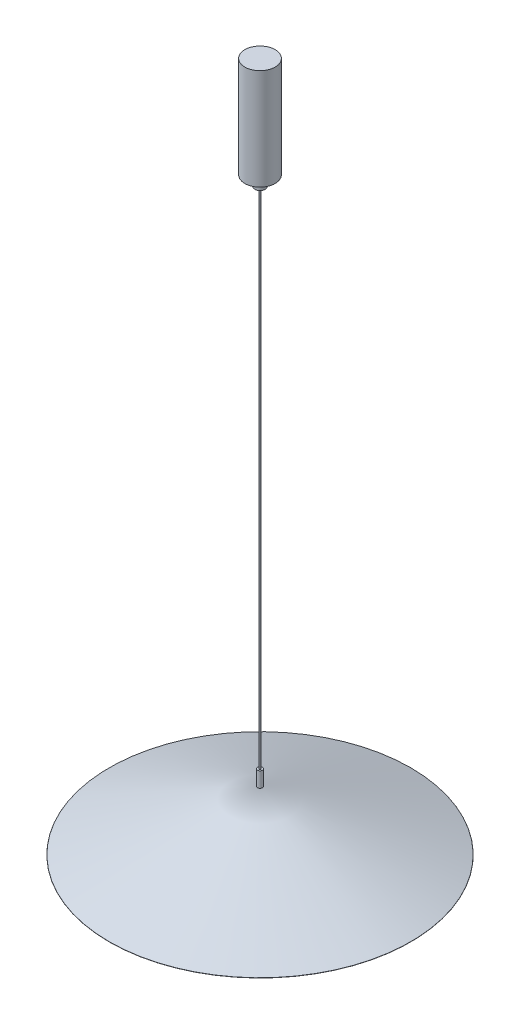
ISO-10303-21;
HEADER;
FILE_DESCRIPTION(('STEP AP214'),'2;1');
FILE_NAME('part.step','',(''),(''),'','','');
FILE_SCHEMA(('AUTOMOTIVE_DESIGN { 1 0 10303 214 1 1 1 1 }'));
ENDSEC;
DATA;
#1=APPLICATION_CONTEXT('core data for automotive mechanical design processes');
#2=APPLICATION_PROTOCOL_DEFINITION('international standard','automotive_design',2000,#1);
#3=PRODUCT_CONTEXT('',#1,'mechanical');
#4=PRODUCT('Part','Part','',(#3));
#5=PRODUCT_RELATED_PRODUCT_CATEGORY('part','',(#4));
#6=PRODUCT_DEFINITION_FORMATION('','',#4);
#7=PRODUCT_DEFINITION_CONTEXT('part definition',#1,'design');
#8=PRODUCT_DEFINITION('design','',#6,#7);
#9=PRODUCT_DEFINITION_SHAPE('','',#8);
#10=(LENGTH_UNIT() NAMED_UNIT(*) SI_UNIT(.MILLI.,.METRE.));
#11=(NAMED_UNIT(*) PLANE_ANGLE_UNIT() SI_UNIT($,.RADIAN.));
#12=(NAMED_UNIT(*) SI_UNIT($,.STERADIAN.) SOLID_ANGLE_UNIT());
#13=UNCERTAINTY_MEASURE_WITH_UNIT(LENGTH_MEASURE(1.E-05),#10,'distance_accuracy_value','');
#14=(GEOMETRIC_REPRESENTATION_CONTEXT(3) GLOBAL_UNCERTAINTY_ASSIGNED_CONTEXT((#13)) GLOBAL_UNIT_ASSIGNED_CONTEXT((#10,
#11,#12)) REPRESENTATION_CONTEXT('',''));
#15=CARTESIAN_POINT('',(0.,0.,0.));
#16=DIRECTION('',(0.,0.,1.));
#17=DIRECTION('',(1.,0.,0.));
#18=AXIS2_PLACEMENT_3D('',#15,#16,#17);
#19=CARTESIAN_POINT('',(0.,65.,0.));
#20=DIRECTION('',(0.,-1.,0.));
#21=DIRECTION('',(1.,0.,0.));
#22=AXIS2_PLACEMENT_3D('',#19,#20,#21);
#23=CYLINDRICAL_SURFACE('',#22,20.);
#24=CARTESIAN_POINT('',(0.,65.,0.));
#25=DIRECTION('',(0.,-1.,0.));
#26=DIRECTION('',(1.,0.,0.));
#27=AXIS2_PLACEMENT_3D('',#24,#25,#26);
#28=CIRCLE('',#27,20.);
#29=CARTESIAN_POINT('',(20.,65.,0.));
#30=VERTEX_POINT('',#29);
#31=EDGE_CURVE('E12',#30,#30,#28,.T.);
#32=ORIENTED_EDGE('',*,*,#31,.T.);
#33=EDGE_LOOP('',(#32));
#34=FACE_BOUND('',#33,.T.);
#35=CARTESIAN_POINT('',(0.,-95.,0.));
#36=DIRECTION('',(0.,-1.,0.));
#37=DIRECTION('',(1.,0.,0.));
#38=AXIS2_PLACEMENT_3D('',#35,#36,#37);
#39=CIRCLE('',#38,20.);
#40=CARTESIAN_POINT('',(20.,-95.,0.));
#41=VERTEX_POINT('',#40);
#42=EDGE_CURVE('E60',#41,#41,#39,.T.);
#43=ORIENTED_EDGE('',*,*,#42,.F.);
#44=EDGE_LOOP('',(#43));
#45=FACE_BOUND('',#44,.T.);
#46=ADVANCED_FACE('F57',(#34,#45),#23,.T.);
#47=CARTESIAN_POINT('',(0.,65.,0.));
#48=DIRECTION('',(0.,-1.,0.));
#49=DIRECTION('',(1.,0.,0.));
#50=AXIS2_PLACEMENT_3D('',#47,#48,#49);
#51=PLANE('',#50);
#52=ORIENTED_EDGE('',*,*,#31,.F.);
#53=EDGE_LOOP('',(#52));
#54=FACE_BOUND('',#53,.T.);
#55=ADVANCED_FACE('F74',(#54),#51,.F.);
#56=CARTESIAN_POINT('',(0.,-95.,0.));
#57=DIRECTION('',(0.,-1.,0.));
#58=DIRECTION('',(1.,0.,0.));
#59=AXIS2_PLACEMENT_3D('',#56,#57,#58);
#60=PLANE('',#59);
#61=ORIENTED_EDGE('',*,*,#42,.T.);
#62=EDGE_LOOP('',(#61));
#63=FACE_BOUND('',#62,.T.);
#64=ADVANCED_FACE('F71',(#63),#60,.T.);
#65=CLOSED_SHELL('',(#46,#55,#64));
#66=MANIFOLD_SOLID_BREP('B2',#65);
#67=CARTESIAN_POINT('',(0.,1368.,0.));
#68=DIRECTION('',(0.,-1.,0.));
#69=DIRECTION('',(0.,0.,-1.));
#70=AXIS2_PLACEMENT_3D('',#67,#68,#69);
#71=CYLINDRICAL_SURFACE('',#70,30.);
#72=CARTESIAN_POINT('',(0.,1368.,0.));
#73=DIRECTION('',(0.,1.,0.));
#74=DIRECTION('',(0.,0.,1.));
#75=AXIS2_PLACEMENT_3D('',#72,#73,#74);
#76=CIRCLE('',#75,30.);
#77=CARTESIAN_POINT('',(0.,1368.,30.));
#78=VERTEX_POINT('',#77);
#79=EDGE_CURVE('E56',#78,#78,#76,.T.);
#80=ORIENTED_EDGE('',*,*,#79,.F.);
#81=EDGE_LOOP('',(#80));
#82=FACE_BOUND('',#81,.T.);
#83=CARTESIAN_POINT('',(0.,1168.,0.));
#84=DIRECTION('',(0.,1.,0.));
#85=DIRECTION('',(0.,0.,1.));
#86=AXIS2_PLACEMENT_3D('',#83,#84,#85);
#87=CIRCLE('',#86,30.);
#88=CARTESIAN_POINT('',(0.,1168.,30.));
#89=VERTEX_POINT('',#88);
#90=EDGE_CURVE('E113',#89,#89,#87,.T.);
#91=ORIENTED_EDGE('',*,*,#90,.T.);
#92=EDGE_LOOP('',(#91));
#93=FACE_BOUND('',#92,.T.);
#94=ADVANCED_FACE('F110',(#82,#93),#71,.T.);
#95=CARTESIAN_POINT('',(0.,1368.,0.));
#96=DIRECTION('',(0.,1.,0.));
#97=DIRECTION('',(0.,0.,1.));
#98=AXIS2_PLACEMENT_3D('',#95,#96,#97);
#99=PLANE('',#98);
#100=ORIENTED_EDGE('',*,*,#79,.T.);
#101=EDGE_LOOP('',(#100));
#102=FACE_BOUND('',#101,.T.);
#103=ADVANCED_FACE('F127',(#102),#99,.T.);
#104=CARTESIAN_POINT('',(0.,1168.,0.));
#105=DIRECTION('',(0.,1.,0.));
#106=DIRECTION('',(0.,0.,1.));
#107=AXIS2_PLACEMENT_3D('',#104,#105,#106);
#108=PLANE('',#107);
#109=ORIENTED_EDGE('',*,*,#90,.F.);
#110=EDGE_LOOP('',(#109));
#111=FACE_BOUND('',#110,.T.);
#112=ADVANCED_FACE('F125',(#111),#108,.F.);
#113=CLOSED_SHELL('',(#94,#103,#112));
#114=MANIFOLD_SOLID_BREP('B7',#113);
#115=CARTESIAN_POINT('',(0.,1168.,0.));
#116=DIRECTION('',(0.,-1.,0.));
#117=DIRECTION('',(0.,0.,-1.));
#118=AXIS2_PLACEMENT_3D('',#115,#116,#117);
#119=CYLINDRICAL_SURFACE('',#118,10.);
#120=CARTESIAN_POINT('',(0.,1168.,0.));
#121=DIRECTION('',(0.,1.,0.));
#122=DIRECTION('',(0.,0.,1.));
#123=AXIS2_PLACEMENT_3D('',#120,#121,#122);
#124=CIRCLE('',#123,10.);
#125=CARTESIAN_POINT('',(0.,1168.,10.));
#126=VERTEX_POINT('',#125);
#127=EDGE_CURVE('E109',#126,#126,#124,.T.);
#128=ORIENTED_EDGE('',*,*,#127,.F.);
#129=EDGE_LOOP('',(#128));
#130=FACE_BOUND('',#129,.T.);
#131=CARTESIAN_POINT('',(0.,1148.,0.));
#132=DIRECTION('',(0.,1.,0.));
#133=DIRECTION('',(0.,0.,1.));
#134=AXIS2_PLACEMENT_3D('',#131,#132,#133);
#135=CIRCLE('',#134,10.);
#136=CARTESIAN_POINT('',(0.,1148.,10.));
#137=VERTEX_POINT('',#136);
#138=EDGE_CURVE('E166',#137,#137,#135,.T.);
#139=ORIENTED_EDGE('',*,*,#138,.T.);
#140=EDGE_LOOP('',(#139));
#141=FACE_BOUND('',#140,.T.);
#142=ADVANCED_FACE('F163',(#130,#141),#119,.T.);
#143=CARTESIAN_POINT('',(0.,1168.,0.));
#144=DIRECTION('',(0.,1.,0.));
#145=DIRECTION('',(0.,0.,1.));
#146=AXIS2_PLACEMENT_3D('',#143,#144,#145);
#147=PLANE('',#146);
#148=ORIENTED_EDGE('',*,*,#127,.T.);
#149=EDGE_LOOP('',(#148));
#150=FACE_BOUND('',#149,.T.);
#151=ADVANCED_FACE('F180',(#150),#147,.T.);
#152=CARTESIAN_POINT('',(0.,1148.,0.));
#153=DIRECTION('',(0.,1.,0.));
#154=DIRECTION('',(0.,0.,1.));
#155=AXIS2_PLACEMENT_3D('',#152,#153,#154);
#156=PLANE('',#155);
#157=ORIENTED_EDGE('',*,*,#138,.F.);
#158=EDGE_LOOP('',(#157));
#159=FACE_BOUND('',#158,.T.);
#160=ADVANCED_FACE('F178',(#159),#156,.F.);
#161=CLOSED_SHELL('',(#142,#151,#160));
#162=MANIFOLD_SOLID_BREP('B51',#161);
#163=CARTESIAN_POINT('',(0.,1148.,0.));
#164=DIRECTION('',(0.,-1.,0.));
#165=DIRECTION('',(0.,0.,-1.));
#166=AXIS2_PLACEMENT_3D('',#163,#164,#165);
#167=CYLINDRICAL_SURFACE('',#166,1.5);
#168=CARTESIAN_POINT('',(0.,1148.,0.));
#169=DIRECTION('',(0.,1.,0.));
#170=DIRECTION('',(0.,0.,1.));
#171=AXIS2_PLACEMENT_3D('',#168,#169,#170);
#172=CIRCLE('',#171,1.5);
#173=CARTESIAN_POINT('',(0.,1148.,1.5));
#174=VERTEX_POINT('',#173);
#175=EDGE_CURVE('E162',#174,#174,#172,.T.);
#176=ORIENTED_EDGE('',*,*,#175,.F.);
#177=EDGE_LOOP('',(#176));
#178=FACE_BOUND('',#177,.T.);
#179=CARTESIAN_POINT('',(0.,148.,0.));
#180=DIRECTION('',(0.,1.,0.));
#181=DIRECTION('',(0.,0.,1.));
#182=AXIS2_PLACEMENT_3D('',#179,#180,#181);
#183=CIRCLE('',#182,1.5);
#184=CARTESIAN_POINT('',(0.,148.,1.5));
#185=VERTEX_POINT('',#184);
#186=EDGE_CURVE('E221',#185,#185,#183,.T.);
#187=ORIENTED_EDGE('',*,*,#186,.T.);
#188=EDGE_LOOP('',(#187));
#189=FACE_BOUND('',#188,.T.);
#190=ADVANCED_FACE('F218',(#178,#189),#167,.T.);
#191=CARTESIAN_POINT('',(0.,1148.,0.));
#192=DIRECTION('',(0.,1.,0.));
#193=DIRECTION('',(0.,0.,1.));
#194=AXIS2_PLACEMENT_3D('',#191,#192,#193);
#195=PLANE('',#194);
#196=ORIENTED_EDGE('',*,*,#175,.T.);
#197=EDGE_LOOP('',(#196));
#198=FACE_BOUND('',#197,.T.);
#199=ADVANCED_FACE('F235',(#198),#195,.T.);
#200=CARTESIAN_POINT('',(0.,148.,0.));
#201=DIRECTION('',(0.,1.,0.));
#202=DIRECTION('',(0.,0.,1.));
#203=AXIS2_PLACEMENT_3D('',#200,#201,#202);
#204=PLANE('',#203);
#205=ORIENTED_EDGE('',*,*,#186,.F.);
#206=EDGE_LOOP('',(#205));
#207=FACE_BOUND('',#206,.T.);
#208=ADVANCED_FACE('F233',(#207),#204,.F.);
#209=CLOSED_SHELL('',(#190,#199,#208));
#210=MANIFOLD_SOLID_BREP('B104',#209);
#211=CARTESIAN_POINT('',(0.,118.,0.));
#212=DIRECTION('',(0.,1.,0.));
#213=DIRECTION('',(0.,0.,1.));
#214=AXIS2_PLACEMENT_3D('',#211,#212,#213);
#215=PLANE('',#214);
#216=CARTESIAN_POINT('',(0.,118.,0.));
#217=DIRECTION('',(0.,1.,0.));
#218=DIRECTION('',(0.,0.,1.));
#219=AXIS2_PLACEMENT_3D('',#216,#217,#218);
#220=CIRCLE('',#219,5.);
#221=CARTESIAN_POINT('',(0.,118.,5.));
#222=VERTEX_POINT('',#221);
#223=EDGE_CURVE('E279',#222,#222,#220,.T.);
#224=ORIENTED_EDGE('',*,*,#223,.F.);
#225=EDGE_LOOP('',(#224));
#226=FACE_BOUND('',#225,.T.);
#227=ADVANCED_FACE('F271',(#226),#215,.F.);
#228=CARTESIAN_POINT('',(0.,148.,0.));
#229=DIRECTION('',(0.,1.,0.));
#230=DIRECTION('',(0.,0.,1.));
#231=AXIS2_PLACEMENT_3D('',#228,#229,#230);
#232=PLANE('',#231);
#233=CARTESIAN_POINT('',(0.,148.,0.));
#234=DIRECTION('',(0.,1.,0.));
#235=DIRECTION('',(0.,0.,1.));
#236=AXIS2_PLACEMENT_3D('',#233,#234,#235);
#237=CIRCLE('',#236,5.);
#238=CARTESIAN_POINT('',(0.,148.,5.));
#239=VERTEX_POINT('',#238);
#240=EDGE_CURVE('E216',#239,#239,#237,.T.);
#241=ORIENTED_EDGE('',*,*,#240,.T.);
#242=EDGE_LOOP('',(#241));
#243=FACE_BOUND('',#242,.T.);
#244=ADVANCED_FACE('F286',(#243),#232,.T.);
#245=CARTESIAN_POINT('',(0.,118.,0.));
#246=DIRECTION('',(0.,1.,0.));
#247=DIRECTION('',(0.,0.,1.));
#248=AXIS2_PLACEMENT_3D('',#245,#246,#247);
#249=CYLINDRICAL_SURFACE('',#248,5.);
#250=ORIENTED_EDGE('',*,*,#240,.F.);
#251=EDGE_LOOP('',(#250));
#252=FACE_BOUND('',#251,.T.);
#253=ORIENTED_EDGE('',*,*,#223,.T.);
#254=EDGE_LOOP('',(#253));
#255=FACE_BOUND('',#254,.T.);
#256=ADVANCED_FACE('F288',(#252,#255),#249,.T.);
#257=CLOSED_SHELL('',(#227,#244,#256));
#258=MANIFOLD_SOLID_BREP('B157',#257);
#259=CARTESIAN_POINT('',(0.,-70.,0.));
#260=DIRECTION('',(0.,1.,0.));
#261=DIRECTION('',(0.,0.,1.));
#262=AXIS2_PLACEMENT_3D('',#259,#260,#261);
#263=PLANE('',#262);
#264=CARTESIAN_POINT('',(0.,-70.,0.));
#265=DIRECTION('',(0.,1.,0.));
#266=DIRECTION('',(0.,0.,1.));
#267=AXIS2_PLACEMENT_3D('',#264,#265,#266);
#268=CIRCLE('',#267,149.);
#269=CARTESIAN_POINT('',(0.,-70.,149.));
#270=VERTEX_POINT('',#269);
#271=EDGE_CURVE('E343',#270,#270,#268,.T.);
#272=ORIENTED_EDGE('',*,*,#271,.T.);
#273=EDGE_LOOP('',(#272));
#274=FACE_BOUND('',#273,.T.);
#275=CARTESIAN_POINT('',(0.,-70.,0.));
#276=DIRECTION('',(0.,1.,0.));
#277=DIRECTION('',(0.,0.,1.));
#278=AXIS2_PLACEMENT_3D('',#275,#276,#277);
#279=CIRCLE('',#278,121.450195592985);
#280=CARTESIAN_POINT('',(0.,-70.,121.450195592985));
#281=VERTEX_POINT('',#280);
#282=EDGE_CURVE('E357',#281,#281,#279,.F.);
#283=ORIENTED_EDGE('',*,*,#282,.T.);
#284=EDGE_LOOP('',(#283));
#285=FACE_BOUND('',#284,.T.);
#286=ADVANCED_FACE('F328',(#274,#285),#263,.T.);
#287=CARTESIAN_POINT('',(0.,-109.238433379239,0.));
#288=DIRECTION('',(0.,1.,0.));
#289=DIRECTION('',(0.,0.,1.));
#290=AXIS2_PLACEMENT_3D('',#287,#288,#289);
#291=CONICAL_SURFACE('',#290,2.28469986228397,1.31115685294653);
#292=CARTESIAN_POINT('',(0.,-108.903259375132,0.));
#293=DIRECTION('',(0.,-1.,0.));
#294=DIRECTION('',(0.,0.,-1.));
#295=AXIS2_PLACEMENT_3D('',#292,#293,#294);
#296=CIRCLE('',#295,3.54648134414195);
#297=CARTESIAN_POINT('',(0.,-108.903259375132,3.54648134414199));
#298=VERTEX_POINT('',#297);
#299=EDGE_CURVE('E270',#298,#298,#296,.F.);
#300=CARTESIAN_POINT('',(0.,-70.2098831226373,0.));
#301=DIRECTION('',(0.,-1.,0.));
#302=DIRECTION('',(0.,0.,-1.));
#303=AXIS2_PLACEMENT_3D('',#300,#301,#302);
#304=CIRCLE('',#303,149.209883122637);
#305=CARTESIAN_POINT('',(0.,-70.2098831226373,149.209883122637));
#306=VERTEX_POINT('',#305);
#307=EDGE_CURVE('E348',#306,#306,#304,.T.);
#308=CARTESIAN_POINT('',(0.,-108.903259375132,3.54648134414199));
#309=CARTESIAN_POINT('',(0.,-108.500203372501,5.06380844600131));
#310=CARTESIAN_POINT('',(0.,-108.097147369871,6.58113554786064));
#311=CARTESIAN_POINT('',(0.,-107.291035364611,9.61578975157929));
#312=CARTESIAN_POINT('',(0.,-106.887979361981,11.1331168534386));
#313=CARTESIAN_POINT('',(0.,-106.081867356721,14.1677710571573));
#314=CARTESIAN_POINT('',(0.,-105.67881135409,15.6850981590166));
#315=CARTESIAN_POINT('',(0.,-104.87269934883,18.7197523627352));
#316=CARTESIAN_POINT('',(0.,-104.4696433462,20.2370794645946));
#317=CARTESIAN_POINT('',(0.,-103.66353134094,23.2717336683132));
#318=CARTESIAN_POINT('',(0.,-103.260475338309,24.7890607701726));
#319=CARTESIAN_POINT('',(0.,-102.454363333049,27.8237149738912));
#320=CARTESIAN_POINT('',(0.,-102.051307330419,29.3410420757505));
#321=CARTESIAN_POINT('',(0.,-101.245195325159,32.3756962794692));
#322=CARTESIAN_POINT('',(0.,-100.842139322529,33.8930233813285));
#323=CARTESIAN_POINT('',(0.,-100.036027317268,36.9276775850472));
#324=CARTESIAN_POINT('',(0.,-99.6329713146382,38.4450046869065));
#325=CARTESIAN_POINT('',(0.,-98.8268593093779,41.4796588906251));
#326=CARTESIAN_POINT('',(0.,-98.4238033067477,42.9969859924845));
#327=CARTESIAN_POINT('',(0.,-97.6176913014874,46.0316401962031));
#328=CARTESIAN_POINT('',(0.,-97.2146352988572,47.5489672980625));
#329=CARTESIAN_POINT('',(0.,-96.408523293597,50.5836215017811));
#330=CARTESIAN_POINT('',(0.,-96.0054672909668,52.1009486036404));
#331=CARTESIAN_POINT('',(0.,-95.1993552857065,55.1356028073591));
#332=CARTESIAN_POINT('',(0.,-94.7962992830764,56.6529299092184));
#333=CARTESIAN_POINT('',(0.,-93.9901872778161,59.6875841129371));
#334=CARTESIAN_POINT('',(0.,-93.5871312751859,61.2049112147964));
#335=CARTESIAN_POINT('',(0.,-92.7810192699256,64.239565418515));
#336=CARTESIAN_POINT('',(0.,-92.3779632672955,65.7568925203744));
#337=CARTESIAN_POINT('',(0.,-91.5718512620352,68.791546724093));
#338=CARTESIAN_POINT('',(0.,-91.168795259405,70.3088738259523));
#339=CARTESIAN_POINT('',(0.,-90.3626832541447,73.343528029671));
#340=CARTESIAN_POINT('',(0.,-89.9596272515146,74.8608551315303));
#341=CARTESIAN_POINT('',(0.,-89.1535152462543,77.895509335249));
#342=CARTESIAN_POINT('',(0.,-88.7504592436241,79.4128364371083));
#343=CARTESIAN_POINT('',(0.,-87.9443472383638,82.4474906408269));
#344=CARTESIAN_POINT('',(0.,-87.5412912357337,83.9648177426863));
#345=CARTESIAN_POINT('',(0.,-86.7351792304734,86.9994719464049));
#346=CARTESIAN_POINT('',(0.,-86.3321232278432,88.5167990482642));
#347=CARTESIAN_POINT('',(0.,-85.5260112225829,91.5514532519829));
#348=CARTESIAN_POINT('',(0.,-85.1229552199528,93.0687803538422));
#349=CARTESIAN_POINT('',(0.,-84.3168432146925,96.1034345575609));
#350=CARTESIAN_POINT('',(0.,-83.9137872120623,97.6207616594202));
#351=CARTESIAN_POINT('',(0.,-83.1076752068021,100.655415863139));
#352=CARTESIAN_POINT('',(0.,-82.7046192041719,102.172742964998));
#353=CARTESIAN_POINT('',(0.,-81.8985071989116,105.207397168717));
#354=CARTESIAN_POINT('',(0.,-81.4954511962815,106.724724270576));
#355=CARTESIAN_POINT('',(0.,-80.6893391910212,109.759378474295));
#356=CARTESIAN_POINT('',(0.,-80.286283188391,111.276705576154));
#357=CARTESIAN_POINT('',(0.,-79.4801711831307,114.311359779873));
#358=CARTESIAN_POINT('',(0.,-79.0771151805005,115.828686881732));
#359=CARTESIAN_POINT('',(0.,-78.2710031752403,118.863341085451));
#360=CARTESIAN_POINT('',(0.,-77.8679471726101,120.38066818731));
#361=CARTESIAN_POINT('',(0.,-77.0618351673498,123.415322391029));
#362=CARTESIAN_POINT('',(0.,-76.6587791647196,124.932649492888));
#363=CARTESIAN_POINT('',(0.,-75.8526671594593,127.967303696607));
#364=CARTESIAN_POINT('',(0.,-75.4496111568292,129.484630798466));
#365=CARTESIAN_POINT('',(0.,-74.6434991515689,132.519285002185));
#366=CARTESIAN_POINT('',(0.,-74.2404431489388,134.036612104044));
#367=CARTESIAN_POINT('',(0.,-73.4343311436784,137.071266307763));
#368=CARTESIAN_POINT('',(0.,-73.0312751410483,138.588593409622));
#369=CARTESIAN_POINT('',(0.,-72.225163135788,141.623247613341));
#370=CARTESIAN_POINT('',(0.,-71.8221071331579,143.1405747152));
#371=CARTESIAN_POINT('',(0.,-71.0159951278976,146.175228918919));
#372=CARTESIAN_POINT('',(0.,-70.6129391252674,147.692556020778));
#373=CARTESIAN_POINT('',(0.,-70.2098831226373,149.209883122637));
#374=B_SPLINE_CURVE_WITH_KNOTS('',3,(#308,#309,#310,#311,#312,#313,#314,#315,#316,#317,#318,
#319,#320,#321,#322,#323,#324,#325,#326,#327,#328,#329,#330,#331,#332,#333,#334,#335,#336,#337,
#338,#339,#340,#341,#342,#343,#344,#345,#346,#347,#348,#349,#350,#351,#352,#353,#354,#355,#356,
#357,#358,#359,#360,#361,#362,#363,#364,#365,#366,#367,#368,#369,#370,#371,#372,#373),
.UNSPECIFIED.,.F.,.F.,(4,2,2,2,2,2,2,2,2,2,2,2,2,2,2,2,2,2,2,2,2,2,2,2,2,2,2,2,2,2,2,2,4),(0.,
4.70984299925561,9.41968599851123,14.1295289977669,18.8393719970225,23.5492149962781,
28.2590579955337,32.9689009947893,37.6787439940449,42.3885869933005,47.0984299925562,
51.8082729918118,56.5181159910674,61.227958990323,65.9378019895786,70.6476449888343,
75.3574879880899,80.0673309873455,84.7771739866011,89.4870169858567,94.1968599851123,
98.906702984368,103.616545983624,108.326388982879,113.036231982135,117.74607498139,
122.455917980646,127.165760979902,131.875603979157,136.585446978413,141.295289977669,
146.005132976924,150.71497597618),.UNSPECIFIED.);
#375=EDGE_CURVE('BSEAM383',#298,#306,#374,.T.);
#376=ORIENTED_EDGE('',*,*,#299,.T.);
#377=ORIENTED_EDGE('',*,*,#307,.T.);
#378=ORIENTED_EDGE('',*,*,#375,.T.);
#379=ORIENTED_EDGE('',*,*,#375,.F.);
#380=EDGE_LOOP('',(#376,#378,#377,#379));
#381=FACE_BOUND('',#380,.T.);
#382=ADVANCED_FACE('F383',(#381),#291,.T.);
#383=CARTESIAN_POINT('',(2.28469986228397,-109.238433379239,0.));
#384=DIRECTION('',(0.,-1.,0.));
#385=DIRECTION('',(0.,0.,-1.));
#386=AXIS2_PLACEMENT_3D('',#383,#384,#385);
#387=PLANE('',#386);
#388=CARTESIAN_POINT('',(0.,-109.238433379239,0.));
#389=DIRECTION('',(0.,-1.,0.));
#390=DIRECTION('',(0.,0.,-1.));
#391=AXIS2_PLACEMENT_3D('',#388,#389,#390);
#392=CIRCLE('',#391,0.979160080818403);
#393=CARTESIAN_POINT('',(0.,-109.238433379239,-0.979160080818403));
#394=VERTEX_POINT('',#393);
#395=EDGE_CURVE('E336',#394,#394,#392,.T.);
#396=ORIENTED_EDGE('',*,*,#395,.T.);
#397=EDGE_LOOP('',(#396));
#398=FACE_BOUND('',#397,.T.);
#399=ADVANCED_FACE('F378',(#398),#387,.T.);
#400=CARTESIAN_POINT('',(0.,-101.506572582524,0.));
#401=DIRECTION('',(0.,1.,0.));
#402=DIRECTION('',(0.,0.,1.));
#403=AXIS2_PLACEMENT_3D('',#400,#401,#402);
#404=CONICAL_SURFACE('',#403,0.230842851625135,1.31115685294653);
#405=CARTESIAN_POINT('',(0.,-70.6703480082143,0.));
#406=DIRECTION('',(0.,1.,0.));
#407=DIRECTION('',(0.,0.,1.));
#408=AXIS2_PLACEMENT_3D('',#405,#406,#407);
#409=CIRCLE('',#408,116.315553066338);
#410=CARTESIAN_POINT('',(0.,-70.6703480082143,116.315553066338));
#411=VERTEX_POINT('',#410);
#412=EDGE_CURVE('E353',#411,#411,#409,.T.);
#413=CARTESIAN_POINT('',(0.,-101.238433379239,0.));
#414=DIRECTION('',(0.,-1.,0.));
#415=DIRECTION('',(0.,0.,-1.));
#416=AXIS2_PLACEMENT_3D('',#413,#414,#415);
#417=CIRCLE('',#416,1.2402680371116);
#418=CARTESIAN_POINT('',(0.,-101.238433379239,1.24026803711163));
#419=VERTEX_POINT('',#418);
#420=EDGE_CURVE('E360',#419,#419,#417,.T.);
#421=CARTESIAN_POINT('',(0.,-70.6703480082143,116.315553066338));
#422=CARTESIAN_POINT('',(0.,-70.9887655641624,115.116852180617));
#423=CARTESIAN_POINT('',(0.,-71.3071831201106,113.918151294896));
#424=CARTESIAN_POINT('',(0.,-71.944018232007,111.520749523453));
#425=CARTESIAN_POINT('',(0.,-72.2624357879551,110.322048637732));
#426=CARTESIAN_POINT('',(0.,-72.8992708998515,107.92464686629));
#427=CARTESIAN_POINT('',(0.,-73.2176884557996,106.725945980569));
#428=CARTESIAN_POINT('',(0.,-73.854523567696,104.328544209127));
#429=CARTESIAN_POINT('',(0.,-74.1729411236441,103.129843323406));
#430=CARTESIAN_POINT('',(0.,-74.8097762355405,100.732441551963));
#431=CARTESIAN_POINT('',(0.,-75.1281937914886,99.5337406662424));
#432=CARTESIAN_POINT('',(0.,-75.765028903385,97.1363388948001));
#433=CARTESIAN_POINT('',(0.,-76.0834464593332,95.9376380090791));
#434=CARTESIAN_POINT('',(0.,-76.7202815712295,93.5402362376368));
#435=CARTESIAN_POINT('',(0.,-77.0386991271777,92.3415353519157));
#436=CARTESIAN_POINT('',(0.,-77.675534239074,89.9441335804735));
#437=CARTESIAN_POINT('',(0.,-77.9939517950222,88.7454326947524));
#438=CARTESIAN_POINT('',(0.,-78.6307869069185,86.3480309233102));
#439=CARTESIAN_POINT('',(0.,-78.9492044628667,85.1493300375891));
#440=CARTESIAN_POINT('',(0.,-79.586039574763,82.7519282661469));
#441=CARTESIAN_POINT('',(0.,-79.9044571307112,81.5532273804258));
#442=CARTESIAN_POINT('',(0.,-80.5412922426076,79.1558256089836));
#443=CARTESIAN_POINT('',(0.,-80.8597097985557,77.9571247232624));
#444=CARTESIAN_POINT('',(0.,-81.4965449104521,75.5597229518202));
#445=CARTESIAN_POINT('',(0.,-81.8149624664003,74.3610220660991));
#446=CARTESIAN_POINT('',(0.,-82.4517975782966,71.9636202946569));
#447=CARTESIAN_POINT('',(0.,-82.7702151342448,70.7649194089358));
#448=CARTESIAN_POINT('',(0.,-83.4070502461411,68.3675176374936));
#449=CARTESIAN_POINT('',(0.,-83.7254678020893,67.1688167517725));
#450=CARTESIAN_POINT('',(0.,-84.3623029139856,64.7714149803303));
#451=CARTESIAN_POINT('',(0.,-84.6807204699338,63.5727140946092));
#452=CARTESIAN_POINT('',(0.,-85.3175555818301,61.1753123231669));
#453=CARTESIAN_POINT('',(0.,-85.6359731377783,59.9766114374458));
#454=CARTESIAN_POINT('',(0.,-86.2728082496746,57.5792096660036));
#455=CARTESIAN_POINT('',(0.,-86.5912258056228,56.3805087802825));
#456=CARTESIAN_POINT('',(0.,-87.2280609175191,53.9831070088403));
#457=CARTESIAN_POINT('',(0.,-87.5464784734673,52.7844061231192));
#458=CARTESIAN_POINT('',(0.,-88.1833135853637,50.387004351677));
#459=CARTESIAN_POINT('',(0.,-88.5017311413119,49.1883034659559));
#460=CARTESIAN_POINT('',(0.,-89.1385662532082,46.7909016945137));
#461=CARTESIAN_POINT('',(0.,-89.4569838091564,45.5922008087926));
#462=CARTESIAN_POINT('',(0.,-90.0938189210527,43.1947990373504));
#463=CARTESIAN_POINT('',(0.,-90.4122364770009,41.9960981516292));
#464=CARTESIAN_POINT('',(0.,-91.0490715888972,39.598696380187));
#465=CARTESIAN_POINT('',(0.,-91.3674891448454,38.3999954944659));
#466=CARTESIAN_POINT('',(0.,-92.0043242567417,36.0025937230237));
#467=CARTESIAN_POINT('',(0.,-92.3227418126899,34.8038928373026));
#468=CARTESIAN_POINT('',(0.,-92.9595769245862,32.4064910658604));
#469=CARTESIAN_POINT('',(0.,-93.2779944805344,31.2077901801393));
#470=CARTESIAN_POINT('',(0.,-93.9148295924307,28.8103884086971));
#471=CARTESIAN_POINT('',(0.,-94.2332471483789,27.611687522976));
#472=CARTESIAN_POINT('',(0.,-94.8700822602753,25.2142857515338));
#473=CARTESIAN_POINT('',(0.,-95.1884998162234,24.0155848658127));
#474=CARTESIAN_POINT('',(0.,-95.8253349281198,21.6181830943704));
#475=CARTESIAN_POINT('',(0.,-96.1437524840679,20.4194822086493));
#476=CARTESIAN_POINT('',(0.,-96.7805875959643,18.0220804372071));
#477=CARTESIAN_POINT('',(0.,-97.0990051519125,16.823379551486));
#478=CARTESIAN_POINT('',(0.,-97.7358402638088,14.4259777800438));
#479=CARTESIAN_POINT('',(0.,-98.054257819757,13.2272768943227));
#480=CARTESIAN_POINT('',(0.,-98.6910929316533,10.8298751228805));
#481=CARTESIAN_POINT('',(0.,-99.0095104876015,9.63117423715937));
#482=CARTESIAN_POINT('',(0.,-99.6463455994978,7.23377246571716));
#483=CARTESIAN_POINT('',(0.,-99.964763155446,6.03507157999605));
#484=CARTESIAN_POINT('',(0.,-100.601598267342,3.63766980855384));
#485=CARTESIAN_POINT('',(0.,-100.920015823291,2.43896892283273));
#486=CARTESIAN_POINT('',(0.,-101.238433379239,1.24026803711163));
#487=B_SPLINE_CURVE_WITH_KNOTS('',3,(#421,#422,#423,#424,#425,#426,#427,#428,#429,#430,#431,
#432,#433,#434,#435,#436,#437,#438,#439,#440,#441,#442,#443,#444,#445,#446,#447,#448,#449,#450,
#451,#452,#453,#454,#455,#456,#457,#458,#459,#460,#461,#462,#463,#464,#465,#466,#467,#468,#469,
#470,#471,#472,#473,#474,#475,#476,#477,#478,#479,#480,#481,#482,#483,#484,#485,#486),
.UNSPECIFIED.,.F.,.F.,(4,2,2,2,2,2,2,2,2,2,2,2,2,2,2,2,2,2,2,2,2,2,2,2,2,2,2,2,2,2,2,2,4),(0.,
3.72081469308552,7.44162938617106,11.1624440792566,14.8832587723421,18.6040734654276,
22.3248881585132,26.0457028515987,29.7665175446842,33.4873322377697,37.2081469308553,
40.9289616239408,44.6497763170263,48.3705910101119,52.0914057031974,55.8122203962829,
59.5330350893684,63.253849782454,66.9746644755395,70.695479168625,74.4162938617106,
78.1371085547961,81.8579232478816,85.5787379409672,89.2995526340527,93.0203673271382,
96.7411820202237,100.461996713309,104.182811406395,107.90362609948,111.624440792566,
115.345255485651,119.066070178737),.UNSPECIFIED.);
#488=EDGE_CURVE('BSEAM365',#411,#419,#487,.T.);
#489=ORIENTED_EDGE('',*,*,#412,.T.);
#490=ORIENTED_EDGE('',*,*,#420,.T.);
#491=ORIENTED_EDGE('',*,*,#488,.T.);
#492=ORIENTED_EDGE('',*,*,#488,.F.);
#493=EDGE_LOOP('',(#489,#491,#490,#492));
#494=FACE_BOUND('',#493,.T.);
#495=ADVANCED_FACE('F365',(#494),#404,.F.);
#496=CARTESIAN_POINT('',(2.28469986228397,-101.238433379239,0.));
#497=DIRECTION('',(0.,-1.,0.));
#498=DIRECTION('',(0.,0.,-1.));
#499=AXIS2_PLACEMENT_3D('',#496,#497,#498);
#500=PLANE('',#499);
#501=ORIENTED_EDGE('',*,*,#420,.F.);
#502=EDGE_LOOP('',(#501));
#503=FACE_BOUND('',#502,.T.);
#504=ADVANCED_FACE('F367',(#503),#500,.F.);
#505=CARTESIAN_POINT('',(0.,-90.,0.));
#506=DIRECTION('',(0.,1.,0.));
#507=DIRECTION('',(0.,0.,1.));
#508=AXIS2_PLACEMENT_3D('',#505,#506,#507);
#509=TOROIDAL_SURFACE('',#508,121.450195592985,20.);
#510=ORIENTED_EDGE('',*,*,#412,.F.);
#511=EDGE_LOOP('',(#510));
#512=FACE_BOUND('',#511,.T.);
#513=ORIENTED_EDGE('',*,*,#282,.F.);
#514=EDGE_LOOP('',(#513));
#515=FACE_BOUND('',#514,.T.);
#516=ADVANCED_FACE('F369',(#512,#515),#509,.T.);
#517=CARTESIAN_POINT('',(0.,-70.2098831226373,0.));
#518=DIRECTION('',(0.,-1.,0.));
#519=DIRECTION('',(0.,0.,-1.));
#520=AXIS2_PLACEMENT_3D('',#517,#518,#519);
#521=CONICAL_SURFACE('',#520,149.209883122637,0.785398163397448);
#522=ORIENTED_EDGE('',*,*,#271,.F.);
#523=EDGE_LOOP('',(#522));
#524=FACE_BOUND('',#523,.T.);
#525=ORIENTED_EDGE('',*,*,#307,.F.);
#526=EDGE_LOOP('',(#525));
#527=FACE_BOUND('',#526,.T.);
#528=ADVANCED_FACE('F375',(#524,#527),#521,.T.);
#529=CARTESIAN_POINT('',(0.,-99.2384333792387,0.));
#530=DIRECTION('',(0.,-1.,0.));
#531=DIRECTION('',(0.,0.,-1.));
#532=AXIS2_PLACEMENT_3D('',#529,#530,#531);
#533=DEGENERATE_TOROIDAL_SURFACE('',#532,0.979160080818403,10.,.T.);
#534=ORIENTED_EDGE('',*,*,#299,.F.);
#535=EDGE_LOOP('',(#534));
#536=FACE_BOUND('',#535,.T.);
#537=ORIENTED_EDGE('',*,*,#395,.F.);
#538=EDGE_LOOP('',(#537));
#539=FACE_BOUND('',#538,.T.);
#540=ADVANCED_FACE('F330',(#536,#539),#533,.T.);
#541=CLOSED_SHELL('',(#286,#382,#399,#495,#504,#516,#528,#540));
#542=MANIFOLD_SOLID_BREP('B210',#541);
#543=CARTESIAN_POINT('',(0.,80.,0.));
#544=DIRECTION('',(0.,-1.,0.));
#545=DIRECTION('',(1.,0.,0.));
#546=AXIS2_PLACEMENT_3D('',#543,#544,#545);
#547=PLANE('',#546);
#548=CARTESIAN_POINT('',(0.,80.,0.));
#549=DIRECTION('',(0.,-1.,0.));
#550=DIRECTION('',(1.,0.,0.));
#551=AXIS2_PLACEMENT_3D('',#548,#549,#550);
#552=CIRCLE('',#551,50.);
#553=CARTESIAN_POINT('',(50.,80.,0.));
#554=VERTEX_POINT('',#553);
#555=EDGE_CURVE('E326',#554,#554,#552,.T.);
#556=ORIENTED_EDGE('',*,*,#555,.F.);
#557=EDGE_LOOP('',(#556));
#558=FACE_BOUND('',#557,.T.);
#559=ADVANCED_FACE('F467',(#558),#547,.F.);
#560=CARTESIAN_POINT('',(0.,80.,0.));
#561=DIRECTION('',(0.,-1.,0.));
#562=DIRECTION('',(1.,0.,0.));
#563=AXIS2_PLACEMENT_3D('',#560,#561,#562);
#564=CYLINDRICAL_SURFACE('',#563,50.);
#565=ORIENTED_EDGE('',*,*,#555,.T.);
#566=EDGE_LOOP('',(#565));
#567=FACE_BOUND('',#566,.T.);
#568=CARTESIAN_POINT('',(0.,-95.,0.));
#569=DIRECTION('',(0.,-1.,0.));
#570=DIRECTION('',(1.,0.,0.));
#571=AXIS2_PLACEMENT_3D('',#568,#569,#570);
#572=CIRCLE('',#571,50.);
#573=CARTESIAN_POINT('',(50.,-95.,0.));
#574=VERTEX_POINT('',#573);
#575=EDGE_CURVE('E474',#574,#574,#572,.T.);
#576=ORIENTED_EDGE('',*,*,#575,.F.);
#577=EDGE_LOOP('',(#576));
#578=FACE_BOUND('',#577,.T.);
#579=ADVANCED_FACE('F478',(#567,#578),#564,.T.);
#580=CARTESIAN_POINT('',(0.,-95.,0.));
#581=DIRECTION('',(0.,-1.,0.));
#582=DIRECTION('',(1.,0.,0.));
#583=AXIS2_PLACEMENT_3D('',#580,#581,#582);
#584=PLANE('',#583);
#585=CARTESIAN_POINT('',(0.,-95.,0.));
#586=DIRECTION('',(0.,-1.,0.));
#587=DIRECTION('',(1.,0.,0.));
#588=AXIS2_PLACEMENT_3D('',#585,#586,#587);
#589=CIRCLE('',#588,47.);
#590=CARTESIAN_POINT('',(47.,-95.,0.));
#591=VERTEX_POINT('',#590);
#592=EDGE_CURVE('E489',#591,#591,#589,.T.);
#593=ORIENTED_EDGE('',*,*,#592,.F.);
#594=EDGE_LOOP('',(#593));
#595=FACE_BOUND('',#594,.T.);
#596=ORIENTED_EDGE('',*,*,#575,.T.);
#597=EDGE_LOOP('',(#596));
#598=FACE_BOUND('',#597,.T.);
#599=ADVANCED_FACE('F481',(#595,#598),#584,.T.);
#600=CARTESIAN_POINT('',(0.,65.,0.));
#601=DIRECTION('',(0.,-1.,0.));
#602=DIRECTION('',(1.,0.,0.));
#603=AXIS2_PLACEMENT_3D('',#600,#601,#602);
#604=CYLINDRICAL_SURFACE('',#603,47.);
#605=CARTESIAN_POINT('',(0.,65.,0.));
#606=DIRECTION('',(0.,-1.,0.));
#607=DIRECTION('',(1.,0.,0.));
#608=AXIS2_PLACEMENT_3D('',#605,#606,#607);
#609=CIRCLE('',#608,47.);
#610=CARTESIAN_POINT('',(47.,65.,0.));
#611=VERTEX_POINT('',#610);
#612=EDGE_CURVE('E486',#611,#611,#609,.T.);
#613=ORIENTED_EDGE('',*,*,#612,.F.);
#614=EDGE_LOOP('',(#613));
#615=FACE_BOUND('',#614,.T.);
#616=ORIENTED_EDGE('',*,*,#592,.T.);
#617=EDGE_LOOP('',(#616));
#618=FACE_BOUND('',#617,.T.);
#619=ADVANCED_FACE('F496',(#615,#618),#604,.F.);
#620=CARTESIAN_POINT('',(0.,65.,0.));
#621=DIRECTION('',(0.,-1.,0.));
#622=DIRECTION('',(1.,0.,0.));
#623=AXIS2_PLACEMENT_3D('',#620,#621,#622);
#624=PLANE('',#623);
#625=ORIENTED_EDGE('',*,*,#612,.T.);
#626=EDGE_LOOP('',(#625));
#627=FACE_BOUND('',#626,.T.);
#628=ADVANCED_FACE('F503',(#627),#624,.T.);
#629=CLOSED_SHELL('',(#559,#579,#599,#619,#628));
#630=MANIFOLD_SOLID_BREP('B265',#629);
#631=CARTESIAN_POINT('',(0.,0.,0.));
#632=DIRECTION('',(0.,-1.,0.));
#633=DIRECTION('',(0.,0.,-1.));
#634=AXIS2_PLACEMENT_3D('',#631,#632,#633);
#635=CONICAL_SURFACE('',#634,300.,1.19028994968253);
#636=CARTESIAN_POINT('',(0.,0.482119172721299,0.));
#637=DIRECTION('',(0.,1.,0.));
#638=DIRECTION('',(0.,0.,1.));
#639=AXIS2_PLACEMENT_3D('',#636,#637,#638);
#640=CIRCLE('',#639,298.794702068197);
#641=CARTESIAN_POINT('',(0.,0.482119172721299,298.794702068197));
#642=VERTEX_POINT('',#641);
#643=EDGE_CURVE('E465',#642,#642,#640,.T.);
#644=ORIENTED_EDGE('',*,*,#643,.T.);
#645=EDGE_LOOP('',(#644));
#646=FACE_BOUND('',#645,.T.);
#647=CARTESIAN_POINT('',(0.,120.,0.));
#648=VERTEX_POINT('',#647);
#649=VERTEX_LOOP('',#648);
#650=FACE_BOUND('',#649,.T.);
#651=ADVANCED_FACE('F549',(#646,#650),#635,.T.);
#652=CARTESIAN_POINT('',(0.,0.,0.));
#653=DIRECTION('',(0.,-1.,0.));
#654=DIRECTION('',(0.,0.,-1.));
#655=AXIS2_PLACEMENT_3D('',#652,#653,#654);
#656=PLANE('',#655);
#657=CARTESIAN_POINT('',(0.,0.,0.));
#658=DIRECTION('',(0.,-1.,0.));
#659=DIRECTION('',(0.,0.,-1.));
#660=AXIS2_PLACEMENT_3D('',#657,#658,#659);
#661=CIRCLE('',#660,298.701854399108);
#662=CARTESIAN_POINT('',(0.,0.,-298.701854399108));
#663=VERTEX_POINT('',#662);
#664=EDGE_CURVE('E558',#663,#663,#661,.T.);
#665=ORIENTED_EDGE('',*,*,#664,.T.);
#666=EDGE_LOOP('',(#665));
#667=FACE_BOUND('',#666,.T.);
#668=CARTESIAN_POINT('',(0.,0.,0.));
#669=DIRECTION('',(0.,-1.,0.));
#670=DIRECTION('',(0.,0.,-1.));
#671=AXIS2_PLACEMENT_3D('',#668,#669,#670);
#672=CIRCLE('',#671,294.614835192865);
#673=CARTESIAN_POINT('',(0.,0.,-294.614835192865));
#674=VERTEX_POINT('',#673);
#675=EDGE_CURVE('E571',#674,#674,#672,.T.);
#676=ORIENTED_EDGE('',*,*,#675,.F.);
#677=EDGE_LOOP('',(#676));
#678=FACE_BOUND('',#677,.T.);
#679=ADVANCED_FACE('F567',(#667,#678),#656,.T.);
#680=CARTESIAN_POINT('',(0.,-1.85695338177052,0.));
#681=DIRECTION('',(0.,-1.,0.));
#682=DIRECTION('',(0.,0.,-1.));
#683=AXIS2_PLACEMENT_3D('',#680,#681,#682);
#684=CONICAL_SURFACE('',#683,299.257218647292,1.19028994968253);
#685=CARTESIAN_POINT('',(0.,117.845934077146,0.));
#686=VERTEX_POINT('',#685);
#687=VERTEX_LOOP('',#686);
#688=FACE_BOUND('',#687,.T.);
#689=ORIENTED_EDGE('',*,*,#675,.T.);
#690=EDGE_LOOP('',(#689));
#691=FACE_BOUND('',#690,.T.);
#692=ADVANCED_FACE('F564',(#688,#691),#684,.F.);
#693=CARTESIAN_POINT('',(0.,0.25,0.));
#694=DIRECTION('',(0.,-1.,0.));
#695=DIRECTION('',(0.,0.,-1.));
#696=AXIS2_PLACEMENT_3D('',#693,#694,#695);
#697=TOROIDAL_SURFACE('',#696,298.701854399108,0.25);
#698=ORIENTED_EDGE('',*,*,#643,.F.);
#699=EDGE_LOOP('',(#698));
#700=FACE_BOUND('',#699,.T.);
#701=ORIENTED_EDGE('',*,*,#664,.F.);
#702=EDGE_LOOP('',(#701));
#703=FACE_BOUND('',#702,.T.);
#704=ADVANCED_FACE('F551',(#700,#703),#697,.T.);
#705=CLOSED_SHELL('',(#651,#679,#692,#704));
#706=MANIFOLD_SOLID_BREP('B320',#705);
#707=ADVANCED_BREP_SHAPE_REPRESENTATION('',(#18,#66,#114,#162,#210,#258,#542,#630,#706),#14);
#708=SHAPE_DEFINITION_REPRESENTATION(#9,#707);
ENDSEC;
END-ISO-10303-21;
